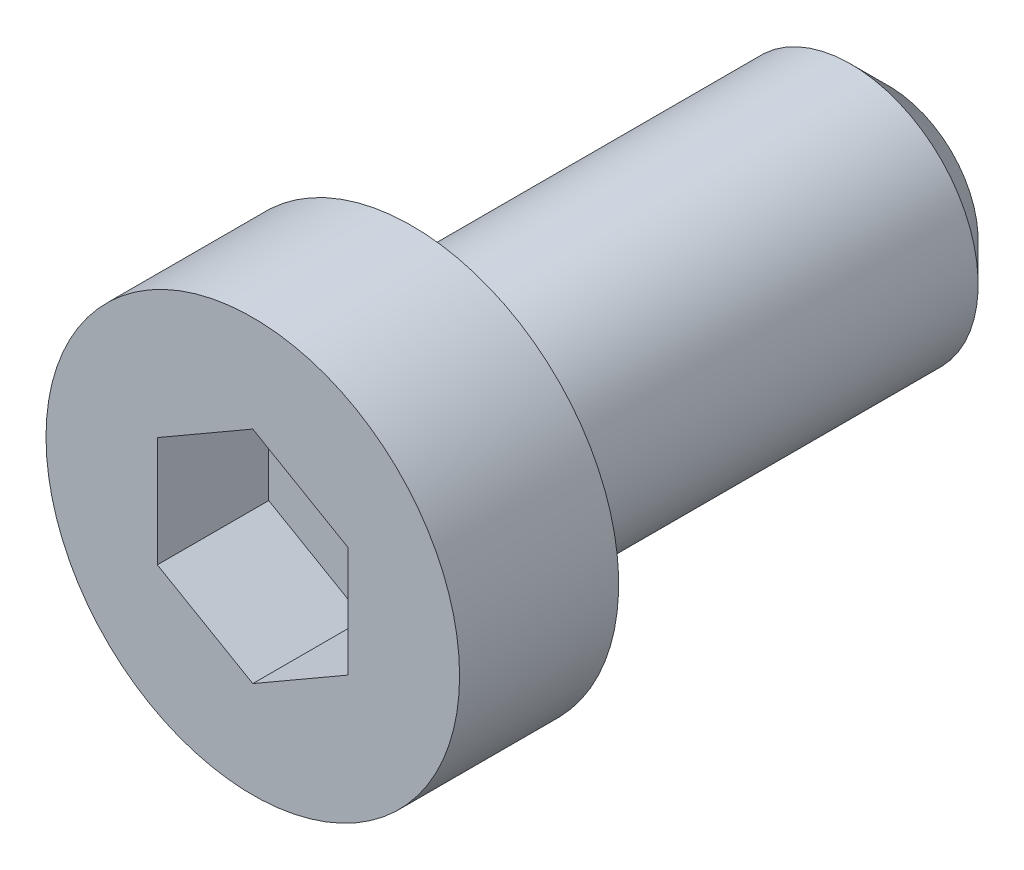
ISO-10303-21;
HEADER;
FILE_DESCRIPTION(('STEP AP214'),'2;1');
FILE_NAME('part.step','',(''),(''),'','','');
FILE_SCHEMA(('AUTOMOTIVE_DESIGN { 1 0 10303 214 1 1 1 1 }'));
ENDSEC;
DATA;
#1=APPLICATION_CONTEXT('core data for automotive mechanical design processes');
#2=APPLICATION_PROTOCOL_DEFINITION('international standard','automotive_design',2000,#1);
#3=PRODUCT_CONTEXT('',#1,'mechanical');
#4=PRODUCT('Part','Part','',(#3));
#5=PRODUCT_RELATED_PRODUCT_CATEGORY('part','',(#4));
#6=PRODUCT_DEFINITION_FORMATION('','',#4);
#7=PRODUCT_DEFINITION_CONTEXT('part definition',#1,'design');
#8=PRODUCT_DEFINITION('design','',#6,#7);
#9=PRODUCT_DEFINITION_SHAPE('','',#8);
#10=(LENGTH_UNIT() NAMED_UNIT(*) SI_UNIT(.MILLI.,.METRE.));
#11=(NAMED_UNIT(*) PLANE_ANGLE_UNIT() SI_UNIT($,.RADIAN.));
#12=(NAMED_UNIT(*) SI_UNIT($,.STERADIAN.) SOLID_ANGLE_UNIT());
#13=UNCERTAINTY_MEASURE_WITH_UNIT(LENGTH_MEASURE(1.E-05),#10,'distance_accuracy_value','');
#14=(GEOMETRIC_REPRESENTATION_CONTEXT(3) GLOBAL_UNCERTAINTY_ASSIGNED_CONTEXT((#13)) GLOBAL_UNIT_ASSIGNED_CONTEXT((#10,
#11,#12)) REPRESENTATION_CONTEXT('',''));
#15=CARTESIAN_POINT('',(0.,0.,0.));
#16=DIRECTION('',(0.,0.,1.));
#17=DIRECTION('',(1.,0.,0.));
#18=AXIS2_PLACEMENT_3D('',#15,#16,#17);
#19=CARTESIAN_POINT('',(0.,0.,0.));
#20=DIRECTION('',(0.,0.,-1.));
#21=DIRECTION('',(-1.,0.,0.));
#22=AXIS2_PLACEMENT_3D('',#19,#20,#21);
#23=CYLINDRICAL_SURFACE('',#22,6.5);
#24=CARTESIAN_POINT('',(0.,0.,0.));
#25=DIRECTION('',(0.,0.,-1.));
#26=DIRECTION('',(-1.,0.,0.));
#27=AXIS2_PLACEMENT_3D('',#24,#25,#26);
#28=CIRCLE('',#27,6.5);
#29=CARTESIAN_POINT('',(-6.5,0.,0.));
#30=VERTEX_POINT('',#29);
#31=EDGE_CURVE('E127',#30,#30,#28,.T.);
#32=ORIENTED_EDGE('',*,*,#31,.F.);
#33=EDGE_LOOP('',(#32));
#34=FACE_BOUND('',#33,.T.);
#35=CARTESIAN_POINT('',(0.,0.,5.));
#36=DIRECTION('',(0.,0.,1.));
#37=DIRECTION('',(1.,0.,0.));
#38=AXIS2_PLACEMENT_3D('',#35,#36,#37);
#39=CIRCLE('',#38,6.5);
#40=CARTESIAN_POINT('',(6.5,0.,5.));
#41=VERTEX_POINT('',#40);
#42=EDGE_CURVE('E116',#41,#41,#39,.T.);
#43=ORIENTED_EDGE('',*,*,#42,.F.);
#44=EDGE_LOOP('',(#43));
#45=FACE_BOUND('',#44,.T.);
#46=ADVANCED_FACE('F14',(#34,#45),#23,.T.);
#47=CARTESIAN_POINT('',(0.,6.5,0.));
#48=DIRECTION('',(0.,0.,1.));
#49=DIRECTION('',(1.,0.,0.));
#50=AXIS2_PLACEMENT_3D('',#47,#48,#49);
#51=PLANE('',#50);
#52=CARTESIAN_POINT('',(0.,0.,0.));
#53=DIRECTION('',(0.,0.,-1.));
#54=DIRECTION('',(-1.,0.,0.));
#55=AXIS2_PLACEMENT_3D('',#52,#53,#54);
#56=CIRCLE('',#55,4.);
#57=CARTESIAN_POINT('',(-4.,0.,0.));
#58=VERTEX_POINT('',#57);
#59=EDGE_CURVE('E124',#58,#58,#56,.T.);
#60=ORIENTED_EDGE('',*,*,#59,.F.);
#61=EDGE_LOOP('',(#60));
#62=FACE_BOUND('',#61,.T.);
#63=ORIENTED_EDGE('',*,*,#31,.T.);
#64=EDGE_LOOP('',(#63));
#65=FACE_BOUND('',#64,.T.);
#66=ADVANCED_FACE('F150',(#62,#65),#51,.F.);
#67=CARTESIAN_POINT('',(0.,0.,0.));
#68=DIRECTION('',(0.,0.,-1.));
#69=DIRECTION('',(-1.,0.,0.));
#70=AXIS2_PLACEMENT_3D('',#67,#68,#69);
#71=CYLINDRICAL_SURFACE('',#70,4.);
#72=CARTESIAN_POINT('',(0.,0.,-13.8));
#73=DIRECTION('',(0.,0.,-1.));
#74=DIRECTION('',(-1.,0.,0.));
#75=AXIS2_PLACEMENT_3D('',#72,#73,#74);
#76=CIRCLE('',#75,4.);
#77=CARTESIAN_POINT('',(-4.,0.,-13.8));
#78=VERTEX_POINT('',#77);
#79=EDGE_CURVE('E9',#78,#78,#76,.F.);
#80=ORIENTED_EDGE('',*,*,#79,.T.);
#81=EDGE_LOOP('',(#80));
#82=FACE_BOUND('',#81,.T.);
#83=ORIENTED_EDGE('',*,*,#59,.T.);
#84=EDGE_LOOP('',(#83));
#85=FACE_BOUND('',#84,.T.);
#86=ADVANCED_FACE('F156',(#82,#85),#71,.T.);
#87=CARTESIAN_POINT('',(0.,0.,-15.));
#88=DIRECTION('',(0.,0.,-1.));
#89=DIRECTION('',(-1.,0.,0.));
#90=AXIS2_PLACEMENT_3D('',#87,#88,#89);
#91=PLANE('',#90);
#92=CARTESIAN_POINT('',(0.,0.,-15.));
#93=DIRECTION('',(0.,0.,-1.));
#94=DIRECTION('',(-1.,0.,0.));
#95=AXIS2_PLACEMENT_3D('',#92,#93,#94);
#96=CIRCLE('',#95,2.8);
#97=CARTESIAN_POINT('',(-2.8,0.,-15.));
#98=VERTEX_POINT('',#97);
#99=EDGE_CURVE('E22',#98,#98,#96,.T.);
#100=ORIENTED_EDGE('',*,*,#99,.T.);
#101=EDGE_LOOP('',(#100));
#102=FACE_BOUND('',#101,.T.);
#103=ADVANCED_FACE('F132',(#102),#91,.T.);
#104=CARTESIAN_POINT('',(0.,0.,5.));
#105=DIRECTION('',(0.,0.,1.));
#106=DIRECTION('',(1.,0.,0.));
#107=AXIS2_PLACEMENT_3D('',#104,#105,#106);
#108=PLANE('',#107);
#109=DIRECTION('',(0.866025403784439,-0.5,0.));
#110=VECTOR('',#109,1.);
#111=CARTESIAN_POINT('',(-3.,-1.73205080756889,5.));
#112=LINE('',#111,#110);
#113=CARTESIAN_POINT('',(-3.,-1.73205080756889,5.));
#114=VERTEX_POINT('',#113);
#115=CARTESIAN_POINT('',(0.,-3.46410161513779,5.));
#116=VERTEX_POINT('',#115);
#117=EDGE_CURVE('E29',#114,#116,#112,.T.);
#118=ORIENTED_EDGE('',*,*,#117,.F.);
#119=DIRECTION('',(0.,-1.,0.));
#120=VECTOR('',#119,1.);
#121=CARTESIAN_POINT('',(-3.,1.73205080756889,5.));
#122=LINE('',#121,#120);
#123=CARTESIAN_POINT('',(-3.,1.73205080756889,5.));
#124=VERTEX_POINT('',#123);
#125=EDGE_CURVE('E112',#124,#114,#122,.T.);
#126=ORIENTED_EDGE('',*,*,#125,.F.);
#127=DIRECTION('',(-0.866025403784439,-0.5,0.));
#128=VECTOR('',#127,1.);
#129=CARTESIAN_POINT('',(0.,3.46410161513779,5.));
#130=LINE('',#129,#128);
#131=CARTESIAN_POINT('',(0.,3.46410161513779,5.));
#132=VERTEX_POINT('',#131);
#133=EDGE_CURVE('E110',#132,#124,#130,.T.);
#134=ORIENTED_EDGE('',*,*,#133,.F.);
#135=DIRECTION('',(-0.866025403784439,0.5,0.));
#136=VECTOR('',#135,1.);
#137=CARTESIAN_POINT('',(3.,1.73205080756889,5.));
#138=LINE('',#137,#136);
#139=CARTESIAN_POINT('',(3.,1.73205080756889,5.));
#140=VERTEX_POINT('',#139);
#141=EDGE_CURVE('E77',#140,#132,#138,.T.);
#142=ORIENTED_EDGE('',*,*,#141,.F.);
#143=DIRECTION('',(0.,1.,0.));
#144=VECTOR('',#143,1.);
#145=CARTESIAN_POINT('',(3.,-1.73205080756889,5.));
#146=LINE('',#145,#144);
#147=CARTESIAN_POINT('',(3.,-1.73205080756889,5.));
#148=VERTEX_POINT('',#147);
#149=EDGE_CURVE('E106',#148,#140,#146,.T.);
#150=ORIENTED_EDGE('',*,*,#149,.F.);
#151=DIRECTION('',(0.866025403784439,0.5,0.));
#152=VECTOR('',#151,1.);
#153=CARTESIAN_POINT('',(0.,-3.46410161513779,5.));
#154=LINE('',#153,#152);
#155=EDGE_CURVE('E103',#116,#148,#154,.T.);
#156=ORIENTED_EDGE('',*,*,#155,.F.);
#157=EDGE_LOOP('',(#118,#126,#134,#142,#150,#156));
#158=FACE_BOUND('',#157,.T.);
#159=ORIENTED_EDGE('',*,*,#42,.T.);
#160=EDGE_LOOP('',(#159));
#161=FACE_BOUND('',#160,.T.);
#162=ADVANCED_FACE('F136',(#158,#161),#108,.T.);
#163=CARTESIAN_POINT('',(0.,0.,-15.));
#164=DIRECTION('',(0.,0.,1.));
#165=DIRECTION('',(1.,0.,0.));
#166=AXIS2_PLACEMENT_3D('',#163,#164,#165);
#167=CONICAL_SURFACE('',#166,2.8,0.785398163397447);
#168=ORIENTED_EDGE('',*,*,#79,.F.);
#169=EDGE_LOOP('',(#168));
#170=FACE_BOUND('',#169,.T.);
#171=ORIENTED_EDGE('',*,*,#99,.F.);
#172=EDGE_LOOP('',(#171));
#173=FACE_BOUND('',#172,.T.);
#174=ADVANCED_FACE('F16',(#170,#173),#167,.T.);
#175=CARTESIAN_POINT('',(-3.,-1.73205080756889,1.5));
#176=DIRECTION('',(-0.5,-0.866025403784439,0.));
#177=DIRECTION('',(0.866025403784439,-0.5,0.));
#178=AXIS2_PLACEMENT_3D('',#175,#176,#177);
#179=PLANE('',#178);
#180=ORIENTED_EDGE('',*,*,#117,.T.);
#181=DIRECTION('',(0.,0.,1.));
#182=VECTOR('',#181,1.);
#183=CARTESIAN_POINT('',(0.,-3.46410161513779,1.5));
#184=LINE('',#183,#182);
#185=CARTESIAN_POINT('',(0.,-3.46410161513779,1.5));
#186=VERTEX_POINT('',#185);
#187=EDGE_CURVE('E59',#186,#116,#184,.T.);
#188=ORIENTED_EDGE('',*,*,#187,.F.);
#189=DIRECTION('',(0.866025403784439,-0.5,0.));
#190=VECTOR('',#189,1.);
#191=CARTESIAN_POINT('',(-3.,-1.73205080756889,1.5));
#192=LINE('',#191,#190);
#193=CARTESIAN_POINT('',(-3.,-1.73205080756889,1.5));
#194=VERTEX_POINT('',#193);
#195=EDGE_CURVE('E114',#194,#186,#192,.T.);
#196=ORIENTED_EDGE('',*,*,#195,.F.);
#197=DIRECTION('',(0.,0.,1.));
#198=VECTOR('',#197,1.);
#199=CARTESIAN_POINT('',(-3.,-1.73205080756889,1.5));
#200=LINE('',#199,#198);
#201=EDGE_CURVE('E37',#194,#114,#200,.T.);
#202=ORIENTED_EDGE('',*,*,#201,.T.);
#203=EDGE_LOOP('',(#180,#188,#196,#202));
#204=FACE_BOUND('',#203,.T.);
#205=ADVANCED_FACE('F135',(#204),#179,.F.);
#206=CARTESIAN_POINT('',(-3.,1.73205080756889,1.5));
#207=DIRECTION('',(-1.,0.,0.));
#208=DIRECTION('',(0.,0.,1.));
#209=AXIS2_PLACEMENT_3D('',#206,#207,#208);
#210=PLANE('',#209);
#211=ORIENTED_EDGE('',*,*,#125,.T.);
#212=ORIENTED_EDGE('',*,*,#201,.F.);
#213=DIRECTION('',(0.,-1.,0.));
#214=VECTOR('',#213,1.);
#215=CARTESIAN_POINT('',(-3.,1.73205080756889,1.5));
#216=LINE('',#215,#214);
#217=CARTESIAN_POINT('',(-3.,1.73205080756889,1.5));
#218=VERTEX_POINT('',#217);
#219=EDGE_CURVE('E89',#218,#194,#216,.T.);
#220=ORIENTED_EDGE('',*,*,#219,.F.);
#221=DIRECTION('',(0.,0.,1.));
#222=VECTOR('',#221,1.);
#223=CARTESIAN_POINT('',(-3.,1.73205080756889,1.5));
#224=LINE('',#223,#222);
#225=EDGE_CURVE('E81',#218,#124,#224,.T.);
#226=ORIENTED_EDGE('',*,*,#225,.T.);
#227=EDGE_LOOP('',(#211,#212,#220,#226));
#228=FACE_BOUND('',#227,.T.);
#229=ADVANCED_FACE('F144',(#228),#210,.F.);
#230=CARTESIAN_POINT('',(0.,3.46410161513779,1.5));
#231=DIRECTION('',(-0.5,0.866025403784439,0.));
#232=DIRECTION('',(-0.866025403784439,-0.5,0.));
#233=AXIS2_PLACEMENT_3D('',#230,#231,#232);
#234=PLANE('',#233);
#235=ORIENTED_EDGE('',*,*,#133,.T.);
#236=ORIENTED_EDGE('',*,*,#225,.F.);
#237=DIRECTION('',(-0.866025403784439,-0.5,0.));
#238=VECTOR('',#237,1.);
#239=CARTESIAN_POINT('',(0.,3.46410161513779,1.5));
#240=LINE('',#239,#238);
#241=CARTESIAN_POINT('',(0.,3.46410161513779,1.5));
#242=VERTEX_POINT('',#241);
#243=EDGE_CURVE('E85',#242,#218,#240,.T.);
#244=ORIENTED_EDGE('',*,*,#243,.F.);
#245=DIRECTION('',(0.,0.,1.));
#246=VECTOR('',#245,1.);
#247=CARTESIAN_POINT('',(0.,3.46410161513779,1.5));
#248=LINE('',#247,#246);
#249=EDGE_CURVE('E70',#242,#132,#248,.T.);
#250=ORIENTED_EDGE('',*,*,#249,.T.);
#251=EDGE_LOOP('',(#235,#236,#244,#250));
#252=FACE_BOUND('',#251,.T.);
#253=ADVANCED_FACE('F86',(#252),#234,.F.);
#254=CARTESIAN_POINT('',(3.,1.73205080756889,1.5));
#255=DIRECTION('',(0.5,0.866025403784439,0.));
#256=DIRECTION('',(-0.866025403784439,0.5,0.));
#257=AXIS2_PLACEMENT_3D('',#254,#255,#256);
#258=PLANE('',#257);
#259=ORIENTED_EDGE('',*,*,#141,.T.);
#260=ORIENTED_EDGE('',*,*,#249,.F.);
#261=DIRECTION('',(-0.866025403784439,0.5,0.));
#262=VECTOR('',#261,1.);
#263=CARTESIAN_POINT('',(3.,1.73205080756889,1.5));
#264=LINE('',#263,#262);
#265=CARTESIAN_POINT('',(3.,1.73205080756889,1.5));
#266=VERTEX_POINT('',#265);
#267=EDGE_CURVE('E74',#266,#242,#264,.T.);
#268=ORIENTED_EDGE('',*,*,#267,.F.);
#269=DIRECTION('',(0.,0.,1.));
#270=VECTOR('',#269,1.);
#271=CARTESIAN_POINT('',(3.,1.73205080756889,1.5));
#272=LINE('',#271,#270);
#273=EDGE_CURVE('E82',#266,#140,#272,.T.);
#274=ORIENTED_EDGE('',*,*,#273,.T.);
#275=EDGE_LOOP('',(#259,#260,#268,#274));
#276=FACE_BOUND('',#275,.T.);
#277=ADVANCED_FACE('F72',(#276),#258,.F.);
#278=CARTESIAN_POINT('',(3.,-1.73205080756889,1.5));
#279=DIRECTION('',(1.,0.,0.));
#280=DIRECTION('',(0.,1.,0.));
#281=AXIS2_PLACEMENT_3D('',#278,#279,#280);
#282=PLANE('',#281);
#283=ORIENTED_EDGE('',*,*,#149,.T.);
#284=ORIENTED_EDGE('',*,*,#273,.F.);
#285=DIRECTION('',(0.,1.,0.));
#286=VECTOR('',#285,1.);
#287=CARTESIAN_POINT('',(3.,-1.73205080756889,1.5));
#288=LINE('',#287,#286);
#289=CARTESIAN_POINT('',(3.,-1.73205080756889,1.5));
#290=VERTEX_POINT('',#289);
#291=EDGE_CURVE('E95',#290,#266,#288,.T.);
#292=ORIENTED_EDGE('',*,*,#291,.F.);
#293=DIRECTION('',(0.,0.,1.));
#294=VECTOR('',#293,1.);
#295=CARTESIAN_POINT('',(3.,-1.73205080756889,1.5));
#296=LINE('',#295,#294);
#297=EDGE_CURVE('E119',#290,#148,#296,.T.);
#298=ORIENTED_EDGE('',*,*,#297,.T.);
#299=EDGE_LOOP('',(#283,#284,#292,#298));
#300=FACE_BOUND('',#299,.T.);
#301=ADVANCED_FACE('F170',(#300),#282,.F.);
#302=CARTESIAN_POINT('',(0.,-3.46410161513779,1.5));
#303=DIRECTION('',(0.5,-0.866025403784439,0.));
#304=DIRECTION('',(0.866025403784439,0.5,0.));
#305=AXIS2_PLACEMENT_3D('',#302,#303,#304);
#306=PLANE('',#305);
#307=ORIENTED_EDGE('',*,*,#155,.T.);
#308=ORIENTED_EDGE('',*,*,#297,.F.);
#309=DIRECTION('',(0.866025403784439,0.5,0.));
#310=VECTOR('',#309,1.);
#311=CARTESIAN_POINT('',(0.,-3.46410161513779,1.5));
#312=LINE('',#311,#310);
#313=EDGE_CURVE('E97',#186,#290,#312,.T.);
#314=ORIENTED_EDGE('',*,*,#313,.F.);
#315=ORIENTED_EDGE('',*,*,#187,.T.);
#316=EDGE_LOOP('',(#307,#308,#314,#315));
#317=FACE_BOUND('',#316,.T.);
#318=ADVANCED_FACE('F167',(#317),#306,.F.);
#319=CARTESIAN_POINT('',(0.,0.,1.5));
#320=DIRECTION('',(0.,0.,1.));
#321=DIRECTION('',(1.,0.,0.));
#322=AXIS2_PLACEMENT_3D('',#319,#320,#321);
#323=PLANE('',#322);
#324=ORIENTED_EDGE('',*,*,#195,.T.);
#325=ORIENTED_EDGE('',*,*,#313,.T.);
#326=ORIENTED_EDGE('',*,*,#291,.T.);
#327=ORIENTED_EDGE('',*,*,#267,.T.);
#328=ORIENTED_EDGE('',*,*,#243,.T.);
#329=ORIENTED_EDGE('',*,*,#219,.T.);
#330=EDGE_LOOP('',(#324,#325,#326,#327,#328,#329));
#331=FACE_BOUND('',#330,.T.);
#332=ADVANCED_FACE('F92',(#331),#323,.T.);
#333=CLOSED_SHELL('',(#46,#66,#86,#103,#162,#174,#205,#229,#253,#277,#301,#318,#332));
#334=MANIFOLD_SOLID_BREP('B1',#333);
#335=ADVANCED_BREP_SHAPE_REPRESENTATION('',(#18,#334),#14);
#336=SHAPE_DEFINITION_REPRESENTATION(#9,#335);
ENDSEC;
END-ISO-10303-21;
